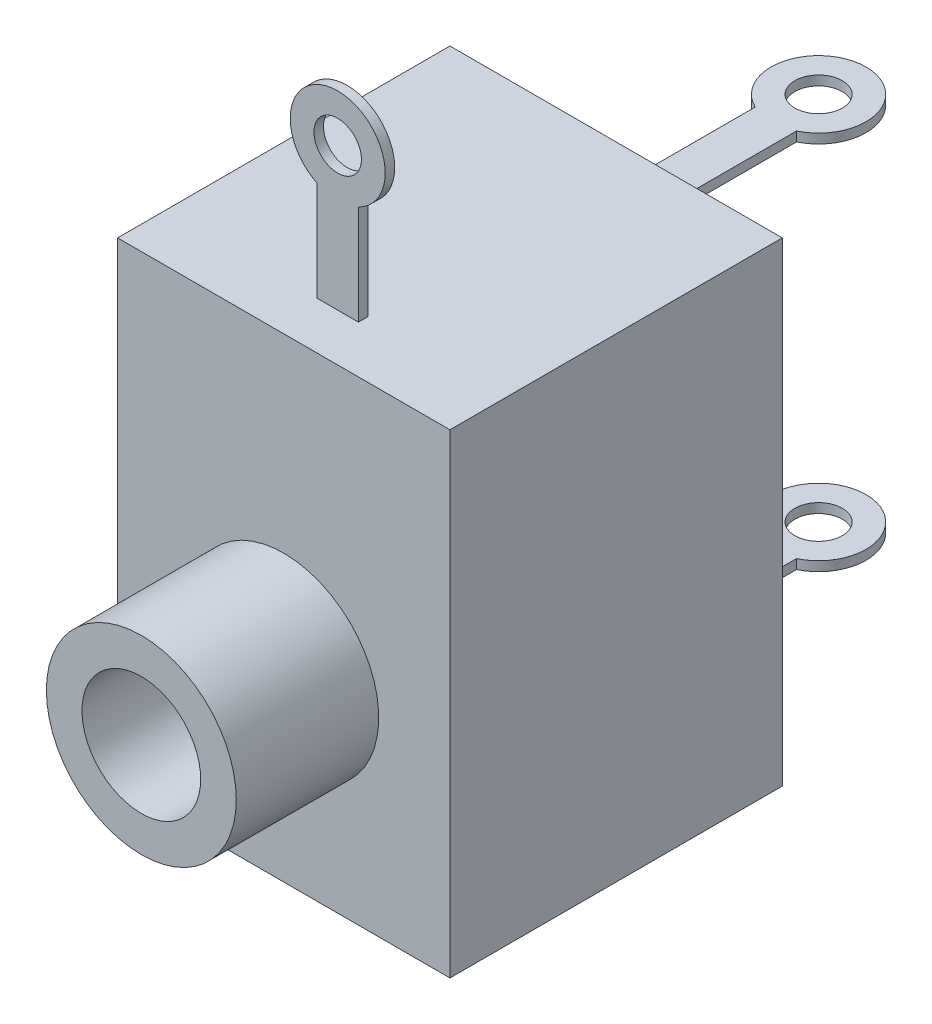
ISO-10303-21;
HEADER;
FILE_DESCRIPTION(('STEP AP214'),'2;1');
FILE_NAME('part.step','',(''),(''),'','','');
FILE_SCHEMA(('AUTOMOTIVE_DESIGN { 1 0 10303 214 1 1 1 1 }'));
ENDSEC;
DATA;
#1=APPLICATION_CONTEXT('core data for automotive mechanical design processes');
#2=APPLICATION_PROTOCOL_DEFINITION('international standard','automotive_design',2000,#1);
#3=PRODUCT_CONTEXT('',#1,'mechanical');
#4=PRODUCT('Part','Part','',(#3));
#5=PRODUCT_RELATED_PRODUCT_CATEGORY('part','',(#4));
#6=PRODUCT_DEFINITION_FORMATION('','',#4);
#7=PRODUCT_DEFINITION_CONTEXT('part definition',#1,'design');
#8=PRODUCT_DEFINITION('design','',#6,#7);
#9=PRODUCT_DEFINITION_SHAPE('','',#8);
#10=(LENGTH_UNIT() NAMED_UNIT(*) SI_UNIT(.MILLI.,.METRE.));
#11=(NAMED_UNIT(*) PLANE_ANGLE_UNIT() SI_UNIT($,.RADIAN.));
#12=(NAMED_UNIT(*) SI_UNIT($,.STERADIAN.) SOLID_ANGLE_UNIT());
#13=UNCERTAINTY_MEASURE_WITH_UNIT(LENGTH_MEASURE(1.E-05),#10,'distance_accuracy_value','');
#14=(GEOMETRIC_REPRESENTATION_CONTEXT(3) GLOBAL_UNCERTAINTY_ASSIGNED_CONTEXT((#13)) GLOBAL_UNIT_ASSIGNED_CONTEXT((#10,
#11,#12)) REPRESENTATION_CONTEXT('',''));
#15=CARTESIAN_POINT('',(0.,0.,0.));
#16=DIRECTION('',(0.,0.,1.));
#17=DIRECTION('',(1.,0.,0.));
#18=AXIS2_PLACEMENT_3D('',#15,#16,#17);
#19=CARTESIAN_POINT('',(3.76411010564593,1.2,-4.));
#20=DIRECTION('',(0.,1.,0.));
#21=DIRECTION('',(0.,0.,1.));
#22=AXIS2_PLACEMENT_3D('',#19,#20,#21);
#23=PLANE('',#22);
#24=DIRECTION('',(0.,0.,-1.));
#25=VECTOR('',#24,1.);
#26=CARTESIAN_POINT('',(4.2,1.2,0.));
#27=LINE('',#26,#25);
#28=CARTESIAN_POINT('',(4.2,1.2,0.));
#29=VERTEX_POINT('',#28);
#30=CARTESIAN_POINT('',(4.2,1.2,-3.1));
#31=VERTEX_POINT('',#30);
#32=EDGE_CURVE('E93',#29,#31,#27,.T.);
#33=ORIENTED_EDGE('',*,*,#32,.T.);
#34=CARTESIAN_POINT('',(3.76411010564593,1.2,-4.));
#35=DIRECTION('',(0.,1.,0.));
#36=DIRECTION('',(0.,0.,1.));
#37=AXIS2_PLACEMENT_3D('',#34,#35,#36);
#38=CIRCLE('',#37,1.);
#39=CARTESIAN_POINT('',(3.32822021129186,1.2,-3.1));
#40=VERTEX_POINT('',#39);
#41=EDGE_CURVE('E88',#31,#40,#38,.T.);
#42=ORIENTED_EDGE('',*,*,#41,.T.);
#43=DIRECTION('',(0.,0.,1.));
#44=VECTOR('',#43,1.);
#45=CARTESIAN_POINT('',(3.32822021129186,1.2,0.));
#46=LINE('',#45,#44);
#47=CARTESIAN_POINT('',(3.32822021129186,1.2,0.));
#48=VERTEX_POINT('',#47);
#49=EDGE_CURVE('E91',#40,#48,#46,.T.);
#50=ORIENTED_EDGE('',*,*,#49,.T.);
#51=DIRECTION('',(1.,0.,0.));
#52=VECTOR('',#51,1.);
#53=CARTESIAN_POINT('',(4.2,1.2,0.));
#54=LINE('',#53,#52);
#55=EDGE_CURVE('E58',#48,#29,#54,.T.);
#56=ORIENTED_EDGE('',*,*,#55,.T.);
#57=EDGE_LOOP('',(#33,#42,#50,#56));
#58=FACE_BOUND('',#57,.T.);
#59=CARTESIAN_POINT('',(3.76411010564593,1.2,-4.));
#60=DIRECTION('',(0.,1.,0.));
#61=DIRECTION('',(0.,0.,1.));
#62=AXIS2_PLACEMENT_3D('',#59,#60,#61);
#63=CIRCLE('',#62,0.5);
#64=CARTESIAN_POINT('',(3.76411010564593,1.2,-3.5));
#65=VERTEX_POINT('',#64);
#66=EDGE_CURVE('E108',#65,#65,#63,.T.);
#67=ORIENTED_EDGE('',*,*,#66,.F.);
#68=EDGE_LOOP('',(#67));
#69=FACE_BOUND('',#68,.T.);
#70=ADVANCED_FACE('F41',(#58,#69),#23,.T.);
#71=CARTESIAN_POINT('',(3.76411010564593,1.,-4.));
#72=DIRECTION('',(0.,1.,0.));
#73=DIRECTION('',(0.,0.,1.));
#74=AXIS2_PLACEMENT_3D('',#71,#72,#73);
#75=PLANE('',#74);
#76=DIRECTION('',(0.,0.,-1.));
#77=VECTOR('',#76,1.);
#78=CARTESIAN_POINT('',(4.2,1.,0.));
#79=LINE('',#78,#77);
#80=CARTESIAN_POINT('',(4.2,1.,0.));
#81=VERTEX_POINT('',#80);
#82=CARTESIAN_POINT('',(4.2,1.,-3.1));
#83=VERTEX_POINT('',#82);
#84=EDGE_CURVE('E105',#81,#83,#79,.T.);
#85=ORIENTED_EDGE('',*,*,#84,.F.);
#86=DIRECTION('',(1.,0.,0.));
#87=VECTOR('',#86,1.);
#88=CARTESIAN_POINT('',(4.2,1.,0.));
#89=LINE('',#88,#87);
#90=CARTESIAN_POINT('',(3.32822021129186,1.,0.));
#91=VERTEX_POINT('',#90);
#92=EDGE_CURVE('E81',#91,#81,#89,.T.);
#93=ORIENTED_EDGE('',*,*,#92,.F.);
#94=DIRECTION('',(0.,0.,1.));
#95=VECTOR('',#94,1.);
#96=CARTESIAN_POINT('',(3.32822021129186,1.,0.));
#97=LINE('',#96,#95);
#98=CARTESIAN_POINT('',(3.32822021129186,1.,-3.1));
#99=VERTEX_POINT('',#98);
#100=EDGE_CURVE('E75',#99,#91,#97,.T.);
#101=ORIENTED_EDGE('',*,*,#100,.F.);
#102=CARTESIAN_POINT('',(3.76411010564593,1.,-4.));
#103=DIRECTION('',(0.,1.,0.));
#104=DIRECTION('',(0.,0.,1.));
#105=AXIS2_PLACEMENT_3D('',#102,#103,#104);
#106=CIRCLE('',#105,1.);
#107=EDGE_CURVE('E97',#83,#99,#106,.T.);
#108=ORIENTED_EDGE('',*,*,#107,.F.);
#109=EDGE_LOOP('',(#85,#93,#101,#108));
#110=FACE_BOUND('',#109,.T.);
#111=CARTESIAN_POINT('',(3.76411010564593,1.,-4.));
#112=DIRECTION('',(0.,1.,0.));
#113=DIRECTION('',(0.,0.,1.));
#114=AXIS2_PLACEMENT_3D('',#111,#112,#113);
#115=CIRCLE('',#114,0.5);
#116=CARTESIAN_POINT('',(3.76411010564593,1.,-3.5));
#117=VERTEX_POINT('',#116);
#118=EDGE_CURVE('E120',#117,#117,#115,.T.);
#119=ORIENTED_EDGE('',*,*,#118,.T.);
#120=EDGE_LOOP('',(#119));
#121=FACE_BOUND('',#120,.T.);
#122=ADVANCED_FACE('F116',(#110,#121),#75,.F.);
#123=CARTESIAN_POINT('',(4.2,1.2,0.));
#124=DIRECTION('',(-1.,0.,0.));
#125=DIRECTION('',(0.,0.,1.));
#126=AXIS2_PLACEMENT_3D('',#123,#124,#125);
#127=PLANE('',#126);
#128=ORIENTED_EDGE('',*,*,#84,.T.);
#129=DIRECTION('',(0.,-1.,0.));
#130=VECTOR('',#129,1.);
#131=CARTESIAN_POINT('',(4.2,1.2,-3.1));
#132=LINE('',#131,#130);
#133=EDGE_CURVE('E12',#31,#83,#132,.T.);
#134=ORIENTED_EDGE('',*,*,#133,.F.);
#135=ORIENTED_EDGE('',*,*,#32,.F.);
#136=DIRECTION('',(0.,-1.,0.));
#137=VECTOR('',#136,1.);
#138=CARTESIAN_POINT('',(4.2,1.2,0.));
#139=LINE('',#138,#137);
#140=EDGE_CURVE('E101',#29,#81,#139,.T.);
#141=ORIENTED_EDGE('',*,*,#140,.T.);
#142=EDGE_LOOP('',(#128,#134,#135,#141));
#143=FACE_BOUND('',#142,.T.);
#144=ADVANCED_FACE('F43',(#143),#127,.F.);
#145=CARTESIAN_POINT('',(3.76411010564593,1.2,-4.));
#146=DIRECTION('',(0.,-1.,0.));
#147=DIRECTION('',(0.,0.,-1.));
#148=AXIS2_PLACEMENT_3D('',#145,#146,#147);
#149=CYLINDRICAL_SURFACE('',#148,1.);
#150=ORIENTED_EDGE('',*,*,#107,.T.);
#151=DIRECTION('',(0.,-1.,0.));
#152=VECTOR('',#151,1.);
#153=CARTESIAN_POINT('',(3.32822021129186,1.2,-3.1));
#154=LINE('',#153,#152);
#155=EDGE_CURVE('E50',#40,#99,#154,.T.);
#156=ORIENTED_EDGE('',*,*,#155,.F.);
#157=ORIENTED_EDGE('',*,*,#41,.F.);
#158=ORIENTED_EDGE('',*,*,#133,.T.);
#159=EDGE_LOOP('',(#150,#156,#157,#158));
#160=FACE_BOUND('',#159,.T.);
#161=ADVANCED_FACE('F96',(#160),#149,.T.);
#162=CARTESIAN_POINT('',(3.32822021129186,1.2,0.));
#163=DIRECTION('',(1.,0.,0.));
#164=DIRECTION('',(0.,0.,-1.));
#165=AXIS2_PLACEMENT_3D('',#162,#163,#164);
#166=PLANE('',#165);
#167=ORIENTED_EDGE('',*,*,#100,.T.);
#168=DIRECTION('',(0.,-1.,0.));
#169=VECTOR('',#168,1.);
#170=CARTESIAN_POINT('',(3.32822021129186,1.2,0.));
#171=LINE('',#170,#169);
#172=EDGE_CURVE('E98',#48,#91,#171,.T.);
#173=ORIENTED_EDGE('',*,*,#172,.F.);
#174=ORIENTED_EDGE('',*,*,#49,.F.);
#175=ORIENTED_EDGE('',*,*,#155,.T.);
#176=EDGE_LOOP('',(#167,#173,#174,#175));
#177=FACE_BOUND('',#176,.T.);
#178=ADVANCED_FACE('F99',(#177),#166,.F.);
#179=CARTESIAN_POINT('',(4.2,1.2,0.));
#180=DIRECTION('',(0.,0.,-1.));
#181=DIRECTION('',(-1.,0.,0.));
#182=AXIS2_PLACEMENT_3D('',#179,#180,#181);
#183=PLANE('',#182);
#184=ORIENTED_EDGE('',*,*,#92,.T.);
#185=ORIENTED_EDGE('',*,*,#140,.F.);
#186=ORIENTED_EDGE('',*,*,#55,.F.);
#187=ORIENTED_EDGE('',*,*,#172,.T.);
#188=EDGE_LOOP('',(#184,#185,#186,#187));
#189=FACE_BOUND('',#188,.T.);
#190=ADVANCED_FACE('F113',(#189),#183,.F.);
#191=CARTESIAN_POINT('',(3.76411010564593,1.2,-4.));
#192=DIRECTION('',(0.,-1.,0.));
#193=DIRECTION('',(0.,0.,-1.));
#194=AXIS2_PLACEMENT_3D('',#191,#192,#193);
#195=CYLINDRICAL_SURFACE('',#194,0.5);
#196=ORIENTED_EDGE('',*,*,#66,.T.);
#197=EDGE_LOOP('',(#196));
#198=FACE_BOUND('',#197,.T.);
#199=ORIENTED_EDGE('',*,*,#118,.F.);
#200=EDGE_LOOP('',(#199));
#201=FACE_BOUND('',#200,.T.);
#202=ADVANCED_FACE('F126',(#198,#201),#195,.F.);
#203=CLOSED_SHELL('',(#70,#122,#144,#161,#178,#190,#202));
#204=MANIFOLD_SOLID_BREP('B2',#203);
#205=CARTESIAN_POINT('',(3.76411010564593,8.8,-4.));
#206=DIRECTION('',(0.,1.,0.));
#207=DIRECTION('',(-1.,0.,0.));
#208=AXIS2_PLACEMENT_3D('',#205,#206,#207);
#209=PLANE('',#208);
#210=DIRECTION('',(0.,0.,1.));
#211=VECTOR('',#210,1.);
#212=CARTESIAN_POINT('',(4.2,8.8,0.));
#213=LINE('',#212,#211);
#214=CARTESIAN_POINT('',(4.2,8.8,-3.1));
#215=VERTEX_POINT('',#214);
#216=CARTESIAN_POINT('',(4.2,8.8,0.));
#217=VERTEX_POINT('',#216);
#218=EDGE_CURVE('E246',#215,#217,#213,.T.);
#219=ORIENTED_EDGE('',*,*,#218,.T.);
#220=DIRECTION('',(-1.,0.,0.));
#221=VECTOR('',#220,1.);
#222=CARTESIAN_POINT('',(4.2,8.8,0.));
#223=LINE('',#222,#221);
#224=CARTESIAN_POINT('',(3.32822021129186,8.8,0.));
#225=VERTEX_POINT('',#224);
#226=EDGE_CURVE('E241',#217,#225,#223,.T.);
#227=ORIENTED_EDGE('',*,*,#226,.T.);
#228=DIRECTION('',(0.,0.,-1.));
#229=VECTOR('',#228,1.);
#230=CARTESIAN_POINT('',(3.32822021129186,8.8,0.));
#231=LINE('',#230,#229);
#232=CARTESIAN_POINT('',(3.32822021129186,8.8,-3.1));
#233=VERTEX_POINT('',#232);
#234=EDGE_CURVE('E244',#225,#233,#231,.T.);
#235=ORIENTED_EDGE('',*,*,#234,.T.);
#236=CARTESIAN_POINT('',(3.76411010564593,8.8,-4.));
#237=DIRECTION('',(0.,-1.,0.));
#238=DIRECTION('',(-1.,0.,0.));
#239=AXIS2_PLACEMENT_3D('',#236,#237,#238);
#240=CIRCLE('',#239,1.);
#241=EDGE_CURVE('E211',#233,#215,#240,.T.);
#242=ORIENTED_EDGE('',*,*,#241,.T.);
#243=EDGE_LOOP('',(#219,#227,#235,#242));
#244=FACE_BOUND('',#243,.T.);
#245=CARTESIAN_POINT('',(3.76411010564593,8.8,-4.));
#246=DIRECTION('',(0.,-1.,0.));
#247=DIRECTION('',(1.,0.,0.));
#248=AXIS2_PLACEMENT_3D('',#245,#246,#247);
#249=CIRCLE('',#248,0.500000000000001);
#250=CARTESIAN_POINT('',(4.26411010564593,8.8,-4.));
#251=VERTEX_POINT('',#250);
#252=EDGE_CURVE('E261',#251,#251,#249,.T.);
#253=ORIENTED_EDGE('',*,*,#252,.F.);
#254=EDGE_LOOP('',(#253));
#255=FACE_BOUND('',#254,.T.);
#256=ADVANCED_FACE('F194',(#244,#255),#209,.F.);
#257=CARTESIAN_POINT('',(3.76411010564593,9.,-4.));
#258=DIRECTION('',(0.,1.,0.));
#259=DIRECTION('',(-1.,0.,0.));
#260=AXIS2_PLACEMENT_3D('',#257,#258,#259);
#261=PLANE('',#260);
#262=DIRECTION('',(0.,0.,1.));
#263=VECTOR('',#262,1.);
#264=CARTESIAN_POINT('',(4.2,9.,0.));
#265=LINE('',#264,#263);
#266=CARTESIAN_POINT('',(4.2,9.,-3.1));
#267=VERTEX_POINT('',#266);
#268=CARTESIAN_POINT('',(4.2,9.,0.));
#269=VERTEX_POINT('',#268);
#270=EDGE_CURVE('E258',#267,#269,#265,.T.);
#271=ORIENTED_EDGE('',*,*,#270,.F.);
#272=CARTESIAN_POINT('',(3.76411010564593,9.,-4.));
#273=DIRECTION('',(0.,-1.,0.));
#274=DIRECTION('',(-1.,0.,0.));
#275=AXIS2_PLACEMENT_3D('',#272,#273,#274);
#276=CIRCLE('',#275,1.);
#277=CARTESIAN_POINT('',(3.32822021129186,9.,-3.1));
#278=VERTEX_POINT('',#277);
#279=EDGE_CURVE('E234',#278,#267,#276,.T.);
#280=ORIENTED_EDGE('',*,*,#279,.F.);
#281=DIRECTION('',(0.,0.,-1.));
#282=VECTOR('',#281,1.);
#283=CARTESIAN_POINT('',(3.32822021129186,9.,0.));
#284=LINE('',#283,#282);
#285=CARTESIAN_POINT('',(3.32822021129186,9.,0.));
#286=VERTEX_POINT('',#285);
#287=EDGE_CURVE('E228',#286,#278,#284,.T.);
#288=ORIENTED_EDGE('',*,*,#287,.F.);
#289=DIRECTION('',(-1.,0.,0.));
#290=VECTOR('',#289,1.);
#291=CARTESIAN_POINT('',(4.2,9.,0.));
#292=LINE('',#291,#290);
#293=EDGE_CURVE('E250',#269,#286,#292,.T.);
#294=ORIENTED_EDGE('',*,*,#293,.F.);
#295=EDGE_LOOP('',(#271,#280,#288,#294));
#296=FACE_BOUND('',#295,.T.);
#297=CARTESIAN_POINT('',(3.76411010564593,9.,-4.));
#298=DIRECTION('',(0.,-1.,0.));
#299=DIRECTION('',(1.,0.,0.));
#300=AXIS2_PLACEMENT_3D('',#297,#298,#299);
#301=CIRCLE('',#300,0.500000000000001);
#302=CARTESIAN_POINT('',(4.26411010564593,9.,-4.));
#303=VERTEX_POINT('',#302);
#304=EDGE_CURVE('E273',#303,#303,#301,.T.);
#305=ORIENTED_EDGE('',*,*,#304,.T.);
#306=EDGE_LOOP('',(#305));
#307=FACE_BOUND('',#306,.T.);
#308=ADVANCED_FACE('F269',(#296,#307),#261,.T.);
#309=CARTESIAN_POINT('',(4.2,8.8,0.));
#310=DIRECTION('',(-1.,0.,0.));
#311=DIRECTION('',(0.,-1.,0.));
#312=AXIS2_PLACEMENT_3D('',#309,#310,#311);
#313=PLANE('',#312);
#314=ORIENTED_EDGE('',*,*,#270,.T.);
#315=DIRECTION('',(0.,1.,0.));
#316=VECTOR('',#315,1.);
#317=CARTESIAN_POINT('',(4.2,8.8,0.));
#318=LINE('',#317,#316);
#319=EDGE_CURVE('E39',#217,#269,#318,.T.);
#320=ORIENTED_EDGE('',*,*,#319,.F.);
#321=ORIENTED_EDGE('',*,*,#218,.F.);
#322=DIRECTION('',(0.,1.,0.));
#323=VECTOR('',#322,1.);
#324=CARTESIAN_POINT('',(4.2,8.8,-3.1));
#325=LINE('',#324,#323);
#326=EDGE_CURVE('E254',#215,#267,#325,.T.);
#327=ORIENTED_EDGE('',*,*,#326,.T.);
#328=EDGE_LOOP('',(#314,#320,#321,#327));
#329=FACE_BOUND('',#328,.T.);
#330=ADVANCED_FACE('F196',(#329),#313,.F.);
#331=CARTESIAN_POINT('',(4.2,8.8,0.));
#332=DIRECTION('',(0.,0.,-1.));
#333=DIRECTION('',(-1.,0.,0.));
#334=AXIS2_PLACEMENT_3D('',#331,#332,#333);
#335=PLANE('',#334);
#336=ORIENTED_EDGE('',*,*,#293,.T.);
#337=DIRECTION('',(0.,1.,0.));
#338=VECTOR('',#337,1.);
#339=CARTESIAN_POINT('',(3.32822021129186,8.8,0.));
#340=LINE('',#339,#338);
#341=EDGE_CURVE('E203',#225,#286,#340,.T.);
#342=ORIENTED_EDGE('',*,*,#341,.F.);
#343=ORIENTED_EDGE('',*,*,#226,.F.);
#344=ORIENTED_EDGE('',*,*,#319,.T.);
#345=EDGE_LOOP('',(#336,#342,#343,#344));
#346=FACE_BOUND('',#345,.T.);
#347=ADVANCED_FACE('F249',(#346),#335,.F.);
#348=CARTESIAN_POINT('',(3.32822021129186,8.8,0.));
#349=DIRECTION('',(1.,0.,0.));
#350=DIRECTION('',(0.,1.,0.));
#351=AXIS2_PLACEMENT_3D('',#348,#349,#350);
#352=PLANE('',#351);
#353=ORIENTED_EDGE('',*,*,#287,.T.);
#354=DIRECTION('',(0.,1.,0.));
#355=VECTOR('',#354,1.);
#356=CARTESIAN_POINT('',(3.32822021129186,8.8,-3.1));
#357=LINE('',#356,#355);
#358=EDGE_CURVE('E251',#233,#278,#357,.T.);
#359=ORIENTED_EDGE('',*,*,#358,.F.);
#360=ORIENTED_EDGE('',*,*,#234,.F.);
#361=ORIENTED_EDGE('',*,*,#341,.T.);
#362=EDGE_LOOP('',(#353,#359,#360,#361));
#363=FACE_BOUND('',#362,.T.);
#364=ADVANCED_FACE('F252',(#363),#352,.F.);
#365=CARTESIAN_POINT('',(3.76411010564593,8.8,-4.));
#366=DIRECTION('',(0.,1.,0.));
#367=DIRECTION('',(-1.,0.,0.));
#368=AXIS2_PLACEMENT_3D('',#365,#366,#367);
#369=CYLINDRICAL_SURFACE('',#368,1.);
#370=ORIENTED_EDGE('',*,*,#279,.T.);
#371=ORIENTED_EDGE('',*,*,#326,.F.);
#372=ORIENTED_EDGE('',*,*,#241,.F.);
#373=ORIENTED_EDGE('',*,*,#358,.T.);
#374=EDGE_LOOP('',(#370,#371,#372,#373));
#375=FACE_BOUND('',#374,.T.);
#376=ADVANCED_FACE('F266',(#375),#369,.T.);
#377=CARTESIAN_POINT('',(3.76411010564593,8.8,-4.));
#378=DIRECTION('',(0.,1.,0.));
#379=DIRECTION('',(-1.,0.,0.));
#380=AXIS2_PLACEMENT_3D('',#377,#378,#379);
#381=CYLINDRICAL_SURFACE('',#380,0.500000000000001);
#382=ORIENTED_EDGE('',*,*,#252,.T.);
#383=EDGE_LOOP('',(#382));
#384=FACE_BOUND('',#383,.T.);
#385=ORIENTED_EDGE('',*,*,#304,.F.);
#386=EDGE_LOOP('',(#385));
#387=FACE_BOUND('',#386,.T.);
#388=ADVANCED_FACE('F279',(#384,#387),#381,.F.);
#389=CLOSED_SHELL('',(#256,#308,#330,#347,#364,#376,#388));
#390=MANIFOLD_SOLID_BREP('B6',#389);
#391=CARTESIAN_POINT('',(0.,10.,7.));
#392=DIRECTION('',(0.,-1.,0.));
#393=DIRECTION('',(1.,0.,0.));
#394=AXIS2_PLACEMENT_3D('',#391,#392,#393);
#395=PLANE('',#394);
#396=DIRECTION('',(-1.,0.,0.));
#397=VECTOR('',#396,1.);
#398=CARTESIAN_POINT('',(0.,10.,0.));
#399=LINE('',#398,#397);
#400=CARTESIAN_POINT('',(7.,10.,0.));
#401=VERTEX_POINT('',#400);
#402=CARTESIAN_POINT('',(0.,10.,0.));
#403=VERTEX_POINT('',#402);
#404=EDGE_CURVE('E509',#401,#403,#399,.T.);
#405=ORIENTED_EDGE('',*,*,#404,.T.);
#406=DIRECTION('',(0.,0.,-1.));
#407=VECTOR('',#406,1.);
#408=CARTESIAN_POINT('',(0.,10.,7.));
#409=LINE('',#408,#407);
#410=CARTESIAN_POINT('',(0.,10.,7.));
#411=VERTEX_POINT('',#410);
#412=EDGE_CURVE('E515',#411,#403,#409,.T.);
#413=ORIENTED_EDGE('',*,*,#412,.F.);
#414=DIRECTION('',(-1.,0.,0.));
#415=VECTOR('',#414,1.);
#416=CARTESIAN_POINT('',(0.,10.,7.));
#417=LINE('',#416,#415);
#418=CARTESIAN_POINT('',(7.,10.,7.));
#419=VERTEX_POINT('',#418);
#420=EDGE_CURVE('E513',#419,#411,#417,.T.);
#421=ORIENTED_EDGE('',*,*,#420,.F.);
#422=DIRECTION('',(0.,0.,-1.));
#423=VECTOR('',#422,1.);
#424=CARTESIAN_POINT('',(7.,10.,7.));
#425=LINE('',#424,#423);
#426=EDGE_CURVE('E525',#419,#401,#425,.T.);
#427=ORIENTED_EDGE('',*,*,#426,.T.);
#428=EDGE_LOOP('',(#405,#413,#421,#427));
#429=FACE_BOUND('',#428,.T.);
#430=DIRECTION('',(0.,0.,-1.));
#431=VECTOR('',#430,1.);
#432=CARTESIAN_POINT('',(4.07183643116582,10.,7.));
#433=LINE('',#432,#431);
#434=CARTESIAN_POINT('',(4.07183643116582,10.,6.));
#435=VERTEX_POINT('',#434);
#436=CARTESIAN_POINT('',(4.07183643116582,10.,5.8));
#437=VERTEX_POINT('',#436);
#438=EDGE_CURVE('E357',#435,#437,#433,.T.);
#439=ORIENTED_EDGE('',*,*,#438,.F.);
#440=DIRECTION('',(-1.,0.,0.));
#441=VECTOR('',#440,1.);
#442=CARTESIAN_POINT('',(0.,10.,6.));
#443=LINE('',#442,#441);
#444=CARTESIAN_POINT('',(3.20005664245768,10.,6.));
#445=VERTEX_POINT('',#444);
#446=EDGE_CURVE('E461',#435,#445,#443,.T.);
#447=ORIENTED_EDGE('',*,*,#446,.T.);
#448=DIRECTION('',(0.,0.,1.));
#449=VECTOR('',#448,1.);
#450=CARTESIAN_POINT('',(3.20005664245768,10.,7.));
#451=LINE('',#450,#449);
#452=CARTESIAN_POINT('',(3.20005664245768,10.,5.8));
#453=VERTEX_POINT('',#452);
#454=EDGE_CURVE('E442',#453,#445,#451,.T.);
#455=ORIENTED_EDGE('',*,*,#454,.F.);
#456=DIRECTION('',(-1.,0.,0.));
#457=VECTOR('',#456,1.);
#458=CARTESIAN_POINT('',(0.,10.,5.8));
#459=LINE('',#458,#457);
#460=EDGE_CURVE('E353',#437,#453,#459,.T.);
#461=ORIENTED_EDGE('',*,*,#460,.F.);
#462=EDGE_LOOP('',(#439,#447,#455,#461));
#463=FACE_BOUND('',#462,.T.);
#464=ADVANCED_FACE('F338',(#429,#463),#395,.F.);
#465=CARTESIAN_POINT('',(0.,0.,7.));
#466=DIRECTION('',(0.,0.,-1.));
#467=DIRECTION('',(-1.,0.,0.));
#468=AXIS2_PLACEMENT_3D('',#465,#466,#467);
#469=PLANE('',#468);
#470=DIRECTION('',(0.,-1.,0.));
#471=VECTOR('',#470,1.);
#472=CARTESIAN_POINT('',(0.,0.,7.));
#473=LINE('',#472,#471);
#474=CARTESIAN_POINT('',(0.,0.,7.));
#475=VERTEX_POINT('',#474);
#476=EDGE_CURVE('E505',#411,#475,#473,.T.);
#477=ORIENTED_EDGE('',*,*,#476,.T.);
#478=DIRECTION('',(1.,0.,0.));
#479=VECTOR('',#478,1.);
#480=CARTESIAN_POINT('',(0.,0.,7.));
#481=LINE('',#480,#479);
#482=CARTESIAN_POINT('',(7.,0.,7.));
#483=VERTEX_POINT('',#482);
#484=EDGE_CURVE('E508',#475,#483,#481,.T.);
#485=ORIENTED_EDGE('',*,*,#484,.T.);
#486=DIRECTION('',(0.,1.,0.));
#487=VECTOR('',#486,1.);
#488=CARTESIAN_POINT('',(7.,0.,7.));
#489=LINE('',#488,#487);
#490=EDGE_CURVE('E511',#483,#419,#489,.T.);
#491=ORIENTED_EDGE('',*,*,#490,.T.);
#492=ORIENTED_EDGE('',*,*,#420,.T.);
#493=EDGE_LOOP('',(#477,#485,#491,#492));
#494=FACE_BOUND('',#493,.T.);
#495=CARTESIAN_POINT('',(3.5,4.,7.));
#496=DIRECTION('',(0.,0.,-1.));
#497=DIRECTION('',(-1.,0.,0.));
#498=AXIS2_PLACEMENT_3D('',#495,#496,#497);
#499=CIRCLE('',#498,2.);
#500=CARTESIAN_POINT('',(1.49999999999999,4.,7.));
#501=VERTEX_POINT('',#500);
#502=EDGE_CURVE('E192',#501,#501,#499,.F.);
#503=ORIENTED_EDGE('',*,*,#502,.F.);
#504=EDGE_LOOP('',(#503));
#505=FACE_BOUND('',#504,.T.);
#506=ADVANCED_FACE('F551',(#494,#505),#469,.F.);
#507=CARTESIAN_POINT('',(0.,0.,0.));
#508=DIRECTION('',(0.,0.,-1.));
#509=DIRECTION('',(-1.,0.,0.));
#510=AXIS2_PLACEMENT_3D('',#507,#508,#509);
#511=PLANE('',#510);
#512=DIRECTION('',(0.,-1.,0.));
#513=VECTOR('',#512,1.);
#514=CARTESIAN_POINT('',(0.,0.,0.));
#515=LINE('',#514,#513);
#516=CARTESIAN_POINT('',(0.,0.,0.));
#517=VERTEX_POINT('',#516);
#518=EDGE_CURVE('E477',#403,#517,#515,.T.);
#519=ORIENTED_EDGE('',*,*,#518,.F.);
#520=ORIENTED_EDGE('',*,*,#404,.F.);
#521=DIRECTION('',(0.,1.,0.));
#522=VECTOR('',#521,1.);
#523=CARTESIAN_POINT('',(7.,0.,0.));
#524=LINE('',#523,#522);
#525=CARTESIAN_POINT('',(7.,0.,0.));
#526=VERTEX_POINT('',#525);
#527=EDGE_CURVE('E520',#526,#401,#524,.T.);
#528=ORIENTED_EDGE('',*,*,#527,.F.);
#529=DIRECTION('',(1.,0.,0.));
#530=VECTOR('',#529,1.);
#531=CARTESIAN_POINT('',(0.,0.,0.));
#532=LINE('',#531,#530);
#533=EDGE_CURVE('E518',#517,#526,#532,.T.);
#534=ORIENTED_EDGE('',*,*,#533,.F.);
#535=EDGE_LOOP('',(#519,#520,#528,#534));
#536=FACE_BOUND('',#535,.T.);
#537=DIRECTION('',(-1.,0.,0.));
#538=VECTOR('',#537,1.);
#539=CARTESIAN_POINT('',(0.,9.,0.));
#540=LINE('',#539,#538);
#541=CARTESIAN_POINT('',(6.,9.,0.));
#542=VERTEX_POINT('',#541);
#543=CARTESIAN_POINT('',(1.,9.,0.));
#544=VERTEX_POINT('',#543);
#545=EDGE_CURVE('E483',#542,#544,#540,.T.);
#546=ORIENTED_EDGE('',*,*,#545,.T.);
#547=DIRECTION('',(0.,-1.,0.));
#548=VECTOR('',#547,1.);
#549=CARTESIAN_POINT('',(1.,0.,0.));
#550=LINE('',#549,#548);
#551=CARTESIAN_POINT('',(1.,1.,0.));
#552=VERTEX_POINT('',#551);
#553=EDGE_CURVE('E473',#544,#552,#550,.T.);
#554=ORIENTED_EDGE('',*,*,#553,.T.);
#555=DIRECTION('',(1.,0.,0.));
#556=VECTOR('',#555,1.);
#557=CARTESIAN_POINT('',(0.,1.,0.));
#558=LINE('',#557,#556);
#559=CARTESIAN_POINT('',(6.,1.,0.));
#560=VERTEX_POINT('',#559);
#561=EDGE_CURVE('E498',#552,#560,#558,.T.);
#562=ORIENTED_EDGE('',*,*,#561,.T.);
#563=DIRECTION('',(0.,1.,0.));
#564=VECTOR('',#563,1.);
#565=CARTESIAN_POINT('',(6.,0.,0.));
#566=LINE('',#565,#564);
#567=EDGE_CURVE('E500',#560,#542,#566,.T.);
#568=ORIENTED_EDGE('',*,*,#567,.T.);
#569=EDGE_LOOP('',(#546,#554,#562,#568));
#570=FACE_BOUND('',#569,.T.);
#571=ADVANCED_FACE('F541',(#536,#570),#511,.T.);
#572=CARTESIAN_POINT('',(0.,0.,7.));
#573=DIRECTION('',(1.,0.,0.));
#574=DIRECTION('',(0.,0.,-1.));
#575=AXIS2_PLACEMENT_3D('',#572,#573,#574);
#576=PLANE('',#575);
#577=ORIENTED_EDGE('',*,*,#518,.T.);
#578=DIRECTION('',(0.,0.,-1.));
#579=VECTOR('',#578,1.);
#580=CARTESIAN_POINT('',(0.,0.,7.));
#581=LINE('',#580,#579);
#582=EDGE_CURVE('E346',#475,#517,#581,.T.);
#583=ORIENTED_EDGE('',*,*,#582,.F.);
#584=ORIENTED_EDGE('',*,*,#476,.F.);
#585=ORIENTED_EDGE('',*,*,#412,.T.);
#586=EDGE_LOOP('',(#577,#583,#584,#585));
#587=FACE_BOUND('',#586,.T.);
#588=ADVANCED_FACE('F340',(#587),#576,.F.);
#589=CARTESIAN_POINT('',(0.,0.,7.));
#590=DIRECTION('',(0.,1.,0.));
#591=DIRECTION('',(0.,0.,1.));
#592=AXIS2_PLACEMENT_3D('',#589,#590,#591);
#593=PLANE('',#592);
#594=ORIENTED_EDGE('',*,*,#533,.T.);
#595=DIRECTION('',(0.,0.,-1.));
#596=VECTOR('',#595,1.);
#597=CARTESIAN_POINT('',(7.,0.,7.));
#598=LINE('',#597,#596);
#599=EDGE_CURVE('E528',#483,#526,#598,.T.);
#600=ORIENTED_EDGE('',*,*,#599,.F.);
#601=ORIENTED_EDGE('',*,*,#484,.F.);
#602=ORIENTED_EDGE('',*,*,#582,.T.);
#603=EDGE_LOOP('',(#594,#600,#601,#602));
#604=FACE_BOUND('',#603,.T.);
#605=ADVANCED_FACE('F533',(#604),#593,.F.);
#606=CARTESIAN_POINT('',(7.,0.,7.));
#607=DIRECTION('',(-1.,0.,0.));
#608=DIRECTION('',(0.,0.,1.));
#609=AXIS2_PLACEMENT_3D('',#606,#607,#608);
#610=PLANE('',#609);
#611=ORIENTED_EDGE('',*,*,#527,.T.);
#612=ORIENTED_EDGE('',*,*,#426,.F.);
#613=ORIENTED_EDGE('',*,*,#490,.F.);
#614=ORIENTED_EDGE('',*,*,#599,.T.);
#615=EDGE_LOOP('',(#611,#612,#613,#614));
#616=FACE_BOUND('',#615,.T.);
#617=ADVANCED_FACE('F546',(#616),#610,.F.);
#618=CARTESIAN_POINT('',(1.,0.,7.));
#619=DIRECTION('',(1.,0.,0.));
#620=DIRECTION('',(0.,0.,-1.));
#621=AXIS2_PLACEMENT_3D('',#618,#619,#620);
#622=PLANE('',#621);
#623=ORIENTED_EDGE('',*,*,#553,.F.);
#624=DIRECTION('',(0.,0.,-1.));
#625=VECTOR('',#624,1.);
#626=CARTESIAN_POINT('',(1.,9.,7.));
#627=LINE('',#626,#625);
#628=CARTESIAN_POINT('',(1.,9.,6.));
#629=VERTEX_POINT('',#628);
#630=EDGE_CURVE('E484',#629,#544,#627,.T.);
#631=ORIENTED_EDGE('',*,*,#630,.F.);
#632=DIRECTION('',(0.,-1.,0.));
#633=VECTOR('',#632,1.);
#634=CARTESIAN_POINT('',(1.,0.,6.));
#635=LINE('',#634,#633);
#636=CARTESIAN_POINT('',(1.,1.,6.));
#637=VERTEX_POINT('',#636);
#638=EDGE_CURVE('E479',#629,#637,#635,.T.);
#639=ORIENTED_EDGE('',*,*,#638,.T.);
#640=DIRECTION('',(0.,0.,-1.));
#641=VECTOR('',#640,1.);
#642=CARTESIAN_POINT('',(1.,1.,7.));
#643=LINE('',#642,#641);
#644=EDGE_CURVE('E474',#637,#552,#643,.T.);
#645=ORIENTED_EDGE('',*,*,#644,.T.);
#646=EDGE_LOOP('',(#623,#631,#639,#645));
#647=FACE_BOUND('',#646,.T.);
#648=ADVANCED_FACE('F582',(#647),#622,.T.);
#649=CARTESIAN_POINT('',(0.,1.,7.));
#650=DIRECTION('',(0.,1.,0.));
#651=DIRECTION('',(0.,0.,1.));
#652=AXIS2_PLACEMENT_3D('',#649,#650,#651);
#653=PLANE('',#652);
#654=ORIENTED_EDGE('',*,*,#561,.F.);
#655=ORIENTED_EDGE('',*,*,#644,.F.);
#656=DIRECTION('',(1.,0.,0.));
#657=VECTOR('',#656,1.);
#658=CARTESIAN_POINT('',(0.,1.,6.));
#659=LINE('',#658,#657);
#660=CARTESIAN_POINT('',(6.,1.,6.));
#661=VERTEX_POINT('',#660);
#662=EDGE_CURVE('E482',#637,#661,#659,.T.);
#663=ORIENTED_EDGE('',*,*,#662,.T.);
#664=DIRECTION('',(0.,0.,-1.));
#665=VECTOR('',#664,1.);
#666=CARTESIAN_POINT('',(6.,1.,7.));
#667=LINE('',#666,#665);
#668=EDGE_CURVE('E478',#661,#560,#667,.T.);
#669=ORIENTED_EDGE('',*,*,#668,.T.);
#670=EDGE_LOOP('',(#654,#655,#663,#669));
#671=FACE_BOUND('',#670,.T.);
#672=ADVANCED_FACE('F711',(#671),#653,.T.);
#673=CARTESIAN_POINT('',(6.,0.,7.));
#674=DIRECTION('',(-1.,0.,0.));
#675=DIRECTION('',(0.,0.,1.));
#676=AXIS2_PLACEMENT_3D('',#673,#674,#675);
#677=PLANE('',#676);
#678=ORIENTED_EDGE('',*,*,#567,.F.);
#679=ORIENTED_EDGE('',*,*,#668,.F.);
#680=DIRECTION('',(0.,1.,0.));
#681=VECTOR('',#680,1.);
#682=CARTESIAN_POINT('',(6.,0.,6.));
#683=LINE('',#682,#681);
#684=CARTESIAN_POINT('',(6.,9.,6.));
#685=VERTEX_POINT('',#684);
#686=EDGE_CURVE('E492',#661,#685,#683,.T.);
#687=ORIENTED_EDGE('',*,*,#686,.T.);
#688=DIRECTION('',(0.,0.,-1.));
#689=VECTOR('',#688,1.);
#690=CARTESIAN_POINT('',(6.,9.,7.));
#691=LINE('',#690,#689);
#692=EDGE_CURVE('E487',#685,#542,#691,.T.);
#693=ORIENTED_EDGE('',*,*,#692,.T.);
#694=EDGE_LOOP('',(#678,#679,#687,#693));
#695=FACE_BOUND('',#694,.T.);
#696=ADVANCED_FACE('F604',(#695),#677,.T.);
#697=CARTESIAN_POINT('',(0.,9.,7.));
#698=DIRECTION('',(0.,-1.,0.));
#699=DIRECTION('',(1.,0.,0.));
#700=AXIS2_PLACEMENT_3D('',#697,#698,#699);
#701=PLANE('',#700);
#702=DIRECTION('',(-1.,0.,0.));
#703=VECTOR('',#702,1.);
#704=CARTESIAN_POINT('',(0.,9.,6.));
#705=LINE('',#704,#703);
#706=EDGE_CURVE('E488',#685,#629,#705,.T.);
#707=ORIENTED_EDGE('',*,*,#706,.T.);
#708=ORIENTED_EDGE('',*,*,#630,.T.);
#709=ORIENTED_EDGE('',*,*,#545,.F.);
#710=ORIENTED_EDGE('',*,*,#692,.F.);
#711=EDGE_LOOP('',(#707,#708,#709,#710));
#712=FACE_BOUND('',#711,.T.);
#713=ADVANCED_FACE('F570',(#712),#701,.T.);
#714=CARTESIAN_POINT('',(0.,0.,6.));
#715=DIRECTION('',(0.,0.,-1.));
#716=DIRECTION('',(-1.,0.,0.));
#717=AXIS2_PLACEMENT_3D('',#714,#715,#716);
#718=PLANE('',#717);
#719=CARTESIAN_POINT('',(3.5,4.,6.));
#720=DIRECTION('',(0.,0.,-1.));
#721=DIRECTION('',(-1.,0.,0.));
#722=AXIS2_PLACEMENT_3D('',#719,#720,#721);
#723=CIRCLE('',#722,1.25);
#724=CARTESIAN_POINT('',(2.25,4.,6.));
#725=VERTEX_POINT('',#724);
#726=EDGE_CURVE('E467',#725,#725,#723,.T.);
#727=ORIENTED_EDGE('',*,*,#726,.F.);
#728=EDGE_LOOP('',(#727));
#729=FACE_BOUND('',#728,.T.);
#730=ORIENTED_EDGE('',*,*,#638,.F.);
#731=ORIENTED_EDGE('',*,*,#706,.F.);
#732=ORIENTED_EDGE('',*,*,#686,.F.);
#733=ORIENTED_EDGE('',*,*,#662,.F.);
#734=EDGE_LOOP('',(#730,#731,#732,#733));
#735=FACE_BOUND('',#734,.T.);
#736=ADVANCED_FACE('F560',(#729,#735),#718,.T.);
#737=CARTESIAN_POINT('',(3.5,4.,10.));
#738=DIRECTION('',(0.,0.,-1.));
#739=DIRECTION('',(-1.,0.,0.));
#740=AXIS2_PLACEMENT_3D('',#737,#738,#739);
#741=CYLINDRICAL_SURFACE('',#740,2.);
#742=CARTESIAN_POINT('',(3.5,4.,10.));
#743=DIRECTION('',(0.,0.,1.));
#744=DIRECTION('',(1.,0.,0.));
#745=AXIS2_PLACEMENT_3D('',#742,#743,#744);
#746=CIRCLE('',#745,2.);
#747=CARTESIAN_POINT('',(5.5,4.,10.));
#748=VERTEX_POINT('',#747);
#749=EDGE_CURVE('E470',#748,#748,#746,.T.);
#750=ORIENTED_EDGE('',*,*,#749,.F.);
#751=EDGE_LOOP('',(#750));
#752=FACE_BOUND('',#751,.T.);
#753=ORIENTED_EDGE('',*,*,#502,.T.);
#754=EDGE_LOOP('',(#753));
#755=FACE_BOUND('',#754,.T.);
#756=ADVANCED_FACE('F557',(#752,#755),#741,.T.);
#757=CARTESIAN_POINT('',(3.5,4.,10.));
#758=DIRECTION('',(0.,0.,1.));
#759=DIRECTION('',(1.,0.,0.));
#760=AXIS2_PLACEMENT_3D('',#757,#758,#759);
#761=PLANE('',#760);
#762=CARTESIAN_POINT('',(3.5,4.,10.));
#763=DIRECTION('',(0.,0.,1.));
#764=DIRECTION('',(1.,0.,0.));
#765=AXIS2_PLACEMENT_3D('',#762,#763,#764);
#766=CIRCLE('',#765,1.25);
#767=CARTESIAN_POINT('',(4.75,4.,10.));
#768=VERTEX_POINT('',#767);
#769=EDGE_CURVE('E464',#768,#768,#766,.T.);
#770=ORIENTED_EDGE('',*,*,#769,.F.);
#771=EDGE_LOOP('',(#770));
#772=FACE_BOUND('',#771,.T.);
#773=ORIENTED_EDGE('',*,*,#749,.T.);
#774=EDGE_LOOP('',(#773));
#775=FACE_BOUND('',#774,.T.);
#776=ADVANCED_FACE('F559',(#772,#775),#761,.T.);
#777=CARTESIAN_POINT('',(3.5,4.,0.));
#778=DIRECTION('',(0.,0.,1.));
#779=DIRECTION('',(1.,0.,0.));
#780=AXIS2_PLACEMENT_3D('',#777,#778,#779);
#781=CYLINDRICAL_SURFACE('',#780,1.25);
#782=ORIENTED_EDGE('',*,*,#726,.T.);
#783=EDGE_LOOP('',(#782));
#784=FACE_BOUND('',#783,.T.);
#785=ORIENTED_EDGE('',*,*,#769,.T.);
#786=EDGE_LOOP('',(#785));
#787=FACE_BOUND('',#786,.T.);
#788=ADVANCED_FACE('F567',(#784,#787),#781,.F.);
#789=CARTESIAN_POINT('',(3.63594653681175,13.,5.8));
#790=DIRECTION('',(0.,0.,1.));
#791=DIRECTION('',(1.,0.,0.));
#792=AXIS2_PLACEMENT_3D('',#789,#790,#791);
#793=PLANE('',#792);
#794=CARTESIAN_POINT('',(3.63594653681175,13.,5.8));
#795=DIRECTION('',(0.,0.,-1.));
#796=DIRECTION('',(-1.,0.,0.));
#797=AXIS2_PLACEMENT_3D('',#794,#795,#796);
#798=CIRCLE('',#797,0.5);
#799=CARTESIAN_POINT('',(3.13594653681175,13.,5.8));
#800=VERTEX_POINT('',#799);
#801=EDGE_CURVE('E455',#800,#800,#798,.T.);
#802=ORIENTED_EDGE('',*,*,#801,.F.);
#803=EDGE_LOOP('',(#802));
#804=FACE_BOUND('',#803,.T.);
#805=DIRECTION('',(0.,-1.,0.));
#806=VECTOR('',#805,1.);
#807=CARTESIAN_POINT('',(4.07183643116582,9.,5.8));
#808=LINE('',#807,#806);
#809=CARTESIAN_POINT('',(4.07183643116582,12.1,5.8));
#810=VERTEX_POINT('',#809);
#811=EDGE_CURVE('E433',#810,#437,#808,.T.);
#812=ORIENTED_EDGE('',*,*,#811,.T.);
#813=ORIENTED_EDGE('',*,*,#460,.T.);
#814=DIRECTION('',(0.,1.,0.));
#815=VECTOR('',#814,1.);
#816=CARTESIAN_POINT('',(3.20005664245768,9.,5.8));
#817=LINE('',#816,#815);
#818=CARTESIAN_POINT('',(3.20005664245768,12.1,5.8));
#819=VERTEX_POINT('',#818);
#820=EDGE_CURVE('E424',#453,#819,#817,.T.);
#821=ORIENTED_EDGE('',*,*,#820,.T.);
#822=CARTESIAN_POINT('',(3.63594653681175,13.,5.8));
#823=DIRECTION('',(0.,0.,-1.));
#824=DIRECTION('',(1.,0.,0.));
#825=AXIS2_PLACEMENT_3D('',#822,#823,#824);
#826=CIRCLE('',#825,1.);
#827=EDGE_CURVE('E429',#819,#810,#826,.T.);
#828=ORIENTED_EDGE('',*,*,#827,.T.);
#829=EDGE_LOOP('',(#812,#813,#821,#828));
#830=FACE_BOUND('',#829,.T.);
#831=ADVANCED_FACE('F427',(#804,#830),#793,.F.);
#832=CARTESIAN_POINT('',(3.63594653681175,13.,6.));
#833=DIRECTION('',(0.,0.,1.));
#834=DIRECTION('',(1.,0.,0.));
#835=AXIS2_PLACEMENT_3D('',#832,#833,#834);
#836=PLANE('',#835);
#837=CARTESIAN_POINT('',(3.63594653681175,13.,6.));
#838=DIRECTION('',(0.,0.,-1.));
#839=DIRECTION('',(-1.,0.,0.));
#840=AXIS2_PLACEMENT_3D('',#837,#838,#839);
#841=CIRCLE('',#840,0.5);
#842=CARTESIAN_POINT('',(3.13594653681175,13.,6.));
#843=VERTEX_POINT('',#842);
#844=EDGE_CURVE('E692',#843,#843,#841,.T.);
#845=ORIENTED_EDGE('',*,*,#844,.T.);
#846=EDGE_LOOP('',(#845));
#847=FACE_BOUND('',#846,.T.);
#848=ORIENTED_EDGE('',*,*,#446,.F.);
#849=DIRECTION('',(0.,-1.,0.));
#850=VECTOR('',#849,1.);
#851=CARTESIAN_POINT('',(4.07183643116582,9.,6.));
#852=LINE('',#851,#850);
#853=CARTESIAN_POINT('',(4.07183643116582,12.1,6.));
#854=VERTEX_POINT('',#853);
#855=EDGE_CURVE('E452',#854,#435,#852,.T.);
#856=ORIENTED_EDGE('',*,*,#855,.F.);
#857=CARTESIAN_POINT('',(3.63594653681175,13.,6.));
#858=DIRECTION('',(0.,0.,-1.));
#859=DIRECTION('',(1.,0.,0.));
#860=AXIS2_PLACEMENT_3D('',#857,#858,#859);
#861=CIRCLE('',#860,1.);
#862=CARTESIAN_POINT('',(3.20005664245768,12.1,6.));
#863=VERTEX_POINT('',#862);
#864=EDGE_CURVE('E457',#863,#854,#861,.T.);
#865=ORIENTED_EDGE('',*,*,#864,.F.);
#866=DIRECTION('',(0.,1.,0.));
#867=VECTOR('',#866,1.);
#868=CARTESIAN_POINT('',(3.20005664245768,9.,6.));
#869=LINE('',#868,#867);
#870=EDGE_CURVE('E439',#445,#863,#869,.T.);
#871=ORIENTED_EDGE('',*,*,#870,.F.);
#872=EDGE_LOOP('',(#848,#856,#865,#871));
#873=FACE_BOUND('',#872,.T.);
#874=ADVANCED_FACE('F637',(#847,#873),#836,.T.);
#875=CARTESIAN_POINT('',(4.07183643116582,9.,5.8));
#876=DIRECTION('',(-1.,0.,0.));
#877=DIRECTION('',(0.,0.,1.));
#878=AXIS2_PLACEMENT_3D('',#875,#876,#877);
#879=PLANE('',#878);
#880=ORIENTED_EDGE('',*,*,#855,.T.);
#881=ORIENTED_EDGE('',*,*,#438,.T.);
#882=ORIENTED_EDGE('',*,*,#811,.F.);
#883=DIRECTION('',(0.,0.,1.));
#884=VECTOR('',#883,1.);
#885=CARTESIAN_POINT('',(4.07183643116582,12.1,5.8));
#886=LINE('',#885,#884);
#887=EDGE_CURVE('E443',#810,#854,#886,.T.);
#888=ORIENTED_EDGE('',*,*,#887,.T.);
#889=EDGE_LOOP('',(#880,#881,#882,#888));
#890=FACE_BOUND('',#889,.T.);
#891=ADVANCED_FACE('F647',(#890),#879,.F.);
#892=CARTESIAN_POINT('',(3.20005664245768,9.,5.8));
#893=DIRECTION('',(1.,0.,0.));
#894=DIRECTION('',(0.,1.,0.));
#895=AXIS2_PLACEMENT_3D('',#892,#893,#894);
#896=PLANE('',#895);
#897=ORIENTED_EDGE('',*,*,#820,.F.);
#898=ORIENTED_EDGE('',*,*,#454,.T.);
#899=ORIENTED_EDGE('',*,*,#870,.T.);
#900=DIRECTION('',(0.,0.,1.));
#901=VECTOR('',#900,1.);
#902=CARTESIAN_POINT('',(3.20005664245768,12.1,5.8));
#903=LINE('',#902,#901);
#904=EDGE_CURVE('E436',#819,#863,#903,.T.);
#905=ORIENTED_EDGE('',*,*,#904,.F.);
#906=EDGE_LOOP('',(#897,#898,#899,#905));
#907=FACE_BOUND('',#906,.T.);
#908=ADVANCED_FACE('F437',(#907),#896,.F.);
#909=CARTESIAN_POINT('',(3.63594653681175,13.,5.8));
#910=DIRECTION('',(0.,0.,1.));
#911=DIRECTION('',(1.,0.,0.));
#912=AXIS2_PLACEMENT_3D('',#909,#910,#911);
#913=CYLINDRICAL_SURFACE('',#912,1.);
#914=ORIENTED_EDGE('',*,*,#864,.T.);
#915=ORIENTED_EDGE('',*,*,#887,.F.);
#916=ORIENTED_EDGE('',*,*,#827,.F.);
#917=ORIENTED_EDGE('',*,*,#904,.T.);
#918=EDGE_LOOP('',(#914,#915,#916,#917));
#919=FACE_BOUND('',#918,.T.);
#920=ADVANCED_FACE('F445',(#919),#913,.T.);
#921=CARTESIAN_POINT('',(3.63594653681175,13.,5.8));
#922=DIRECTION('',(0.,0.,1.));
#923=DIRECTION('',(1.,0.,0.));
#924=AXIS2_PLACEMENT_3D('',#921,#922,#923);
#925=CYLINDRICAL_SURFACE('',#924,0.5);
#926=ORIENTED_EDGE('',*,*,#801,.T.);
#927=EDGE_LOOP('',(#926));
#928=FACE_BOUND('',#927,.T.);
#929=ORIENTED_EDGE('',*,*,#844,.F.);
#930=EDGE_LOOP('',(#929));
#931=FACE_BOUND('',#930,.T.);
#932=ADVANCED_FACE('F671',(#928,#931),#925,.F.);
#933=CLOSED_SHELL('',(#464,#506,#571,#588,#605,#617,#648,#672,#696,#713,#736,#756,#776,#788,
#831,#874,#891,#908,#920,#932));
#934=MANIFOLD_SOLID_BREP('B33',#933);
#935=ADVANCED_BREP_SHAPE_REPRESENTATION('',(#18,#204,#390,#934),#14);
#936=SHAPE_DEFINITION_REPRESENTATION(#9,#935);
ENDSEC;
END-ISO-10303-21;
